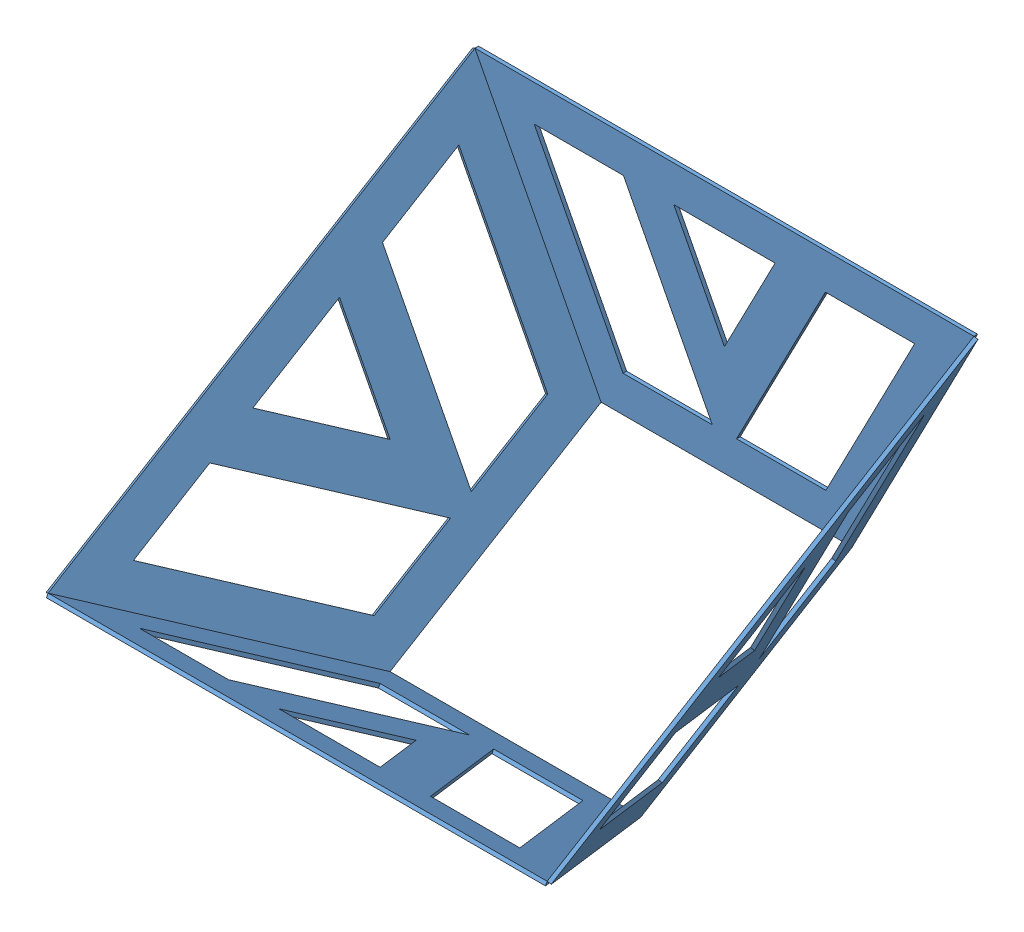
SolidWorks assembly base2-tier2.SLDASM, configuration Default (file format 8000). Lengths in mm.
Overall size (890.2 772.31 946.89).
4 component instances, 1 part files, 7 mates.
Components (placement in the parent):
- Base-2-tier2-2: Base-2-tier2.SLDPRT [Default] at (232.6721 -344.3629 633.1329) x (0 -0.518128 0.855303) z (-0.855303 0.443156 0.268456) size (879.34 429.08 6.35)
- Base-2-tier2-3: Base-2-tier2.SLDPRT [Default] at (366.0986 -269.6028 516.0722) x (1 0 0) z (0 -0.886313 0.463087) size (879.34 429.08 6.35)
- Base-2-tier2-4: Base-2-tier2.SLDPRT [Default] at (421.7924 -304.0874 566.648) x (0 0.518128 -0.855303) z (0.855303 0.443156 0.268456) size (879.34 429.08 6.35)
- Base-2-tier2-5: Base-2-tier2.SLDPRT [Default] at (366.0986 -373.2194 680.7681) size (879.34 429.08 6.35)
Mates (geometry in assembly coordinates):
- Coincident2: coincident aligned: line of Base-2-tier2-3 through (-112.4352 212.7285 1439.2162) axis (0.460044 -0.411174 -0.786954); line of Base-2-tier2-4 through (-112.4352 212.7285 1439.2162) axis (0.460044 -0.411174 -0.786954)
- Coincident4: coincident aligned: line of Base-2-tier2-2 through (544.5822 14.0276 1058.9183) axis (0.460044 0.411174 0.786954); line of Base-2-tier2-3 through (544.5822 14.0276 1058.9183) axis (0.460044 0.411174 0.786954)
- Perpendicular1: perpendicular: line of Base-2-tier2-2 through (766.8998 212.7285 1439.2162) axis (0 0.518128 -0.855303); line of Base-2-tier2-3 through (766.8998 212.7285 1439.2162) axis (-1 0 0)
- Coincident6: coincident: point of Base-2-tier2-2; point of Base-2-tier2-3
- Coincident7: coincident anti-aligned: line of Base-2-tier2-2 through (766.8998 668.3363 687.1181) axis (-0.460044 -0.887896 0); line of Base-2-tier2-5 through (544.5822 239.2576 687.1181) axis (0.460044 0.887896 0)
- Coincident8: coincident anti-aligned: line of Base-2-tier2-4 through (109.8823 239.2576 687.1181) axis (-0.460044 0.887896 0); line of Base-2-tier2-5 through (-112.4352 668.3363 687.1181) axis (0.460044 -0.887896 0)
- Perpendicular2: perpendicular: line of Base-2-tier2-4 through (-112.4352 668.3363 687.1181) axis (0 -0.518128 0.855303); line of Base-2-tier2-5 through (766.8998 668.3363 687.1181) axis (-1 0 0)
